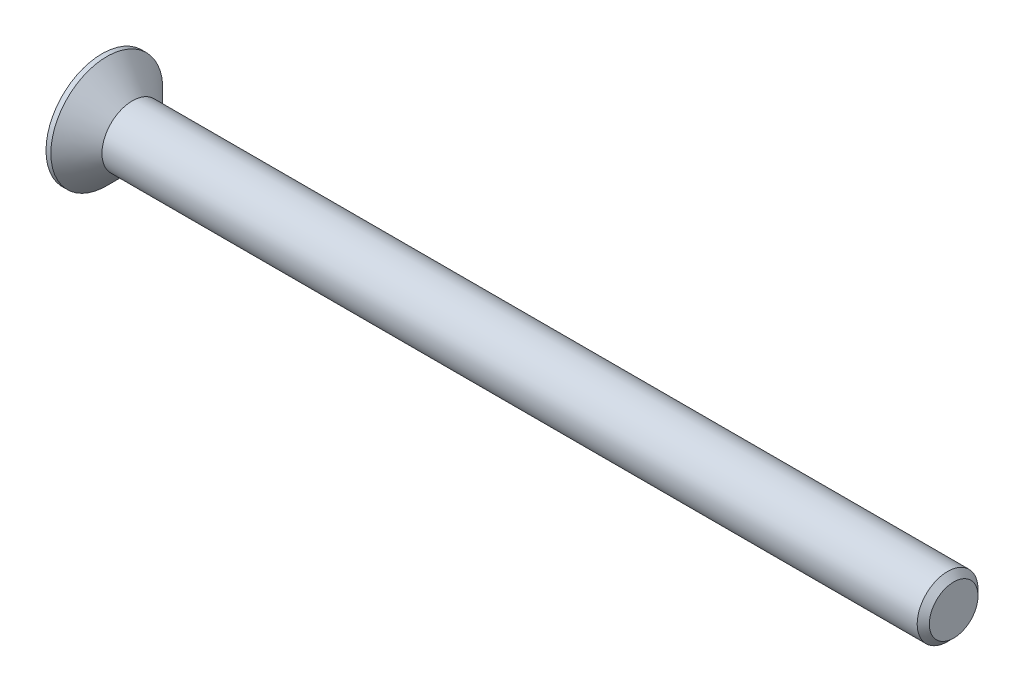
ISO-10303-21;
HEADER;
FILE_DESCRIPTION(('STEP AP214'),'2;1');
FILE_NAME('part.step','',(''),(''),'','','');
FILE_SCHEMA(('AUTOMOTIVE_DESIGN { 1 0 10303 214 1 1 1 1 }'));
ENDSEC;
DATA;
#1=APPLICATION_CONTEXT('core data for automotive mechanical design processes');
#2=APPLICATION_PROTOCOL_DEFINITION('international standard','automotive_design',2000,#1);
#3=PRODUCT_CONTEXT('',#1,'mechanical');
#4=PRODUCT('Part','Part','',(#3));
#5=PRODUCT_RELATED_PRODUCT_CATEGORY('part','',(#4));
#6=PRODUCT_DEFINITION_FORMATION('','',#4);
#7=PRODUCT_DEFINITION_CONTEXT('part definition',#1,'design');
#8=PRODUCT_DEFINITION('design','',#6,#7);
#9=PRODUCT_DEFINITION_SHAPE('','',#8);
#10=(LENGTH_UNIT() NAMED_UNIT(*) SI_UNIT(.MILLI.,.METRE.));
#11=(NAMED_UNIT(*) PLANE_ANGLE_UNIT() SI_UNIT($,.RADIAN.));
#12=(NAMED_UNIT(*) SI_UNIT($,.STERADIAN.) SOLID_ANGLE_UNIT());
#13=UNCERTAINTY_MEASURE_WITH_UNIT(LENGTH_MEASURE(1.E-05),#10,'distance_accuracy_value','');
#14=(GEOMETRIC_REPRESENTATION_CONTEXT(3) GLOBAL_UNCERTAINTY_ASSIGNED_CONTEXT((#13)) GLOBAL_UNIT_ASSIGNED_CONTEXT((#10,
#11,#12)) REPRESENTATION_CONTEXT('',''));
#15=CARTESIAN_POINT('',(0.,0.,0.));
#16=DIRECTION('',(0.,0.,1.));
#17=DIRECTION('',(1.,0.,0.));
#18=AXIS2_PLACEMENT_3D('',#15,#16,#17);
#19=CARTESIAN_POINT('',(0.,0.,0.));
#20=DIRECTION('',(-1.,0.,0.));
#21=DIRECTION('',(0.,0.,1.));
#22=AXIS2_PLACEMENT_3D('',#19,#20,#21);
#23=CONICAL_SURFACE('',#22,2.5,0.78539816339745);
#24=CARTESIAN_POINT('',(-2.09999999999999,0.,0.));
#25=DIRECTION('',(-1.,0.,0.));
#26=DIRECTION('',(0.,0.,1.));
#27=AXIS2_PLACEMENT_3D('',#24,#25,#26);
#28=CIRCLE('',#27,4.6);
#29=CARTESIAN_POINT('',(-2.09999999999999,0.,4.6));
#30=VERTEX_POINT('',#29);
#31=EDGE_CURVE('E189',#30,#30,#28,.T.);
#32=ORIENTED_EDGE('',*,*,#31,.F.);
#33=EDGE_LOOP('',(#32));
#34=FACE_BOUND('',#33,.T.);
#35=CARTESIAN_POINT('',(0.,0.,0.));
#36=DIRECTION('',(-1.,0.,0.));
#37=DIRECTION('',(0.,0.,1.));
#38=AXIS2_PLACEMENT_3D('',#35,#36,#37);
#39=CIRCLE('',#38,2.5);
#40=CARTESIAN_POINT('',(0.,0.,2.5));
#41=VERTEX_POINT('',#40);
#42=EDGE_CURVE('E212',#41,#41,#39,.T.);
#43=ORIENTED_EDGE('',*,*,#42,.T.);
#44=EDGE_LOOP('',(#43));
#45=FACE_BOUND('',#44,.T.);
#46=ADVANCED_FACE('F33',(#34,#45),#23,.T.);
#47=CARTESIAN_POINT('',(-2.5,0.,0.));
#48=DIRECTION('',(-1.,0.,0.));
#49=DIRECTION('',(0.,0.,1.));
#50=AXIS2_PLACEMENT_3D('',#47,#48,#49);
#51=CYLINDRICAL_SURFACE('',#50,2.5);
#52=CARTESIAN_POINT('',(67.,0.,0.));
#53=DIRECTION('',(-1.,0.,0.));
#54=DIRECTION('',(0.,0.,1.));
#55=AXIS2_PLACEMENT_3D('',#52,#53,#54);
#56=CIRCLE('',#55,2.5);
#57=CARTESIAN_POINT('',(67.,0.,2.5));
#58=VERTEX_POINT('',#57);
#59=EDGE_CURVE('E41',#58,#58,#56,.T.);
#60=ORIENTED_EDGE('',*,*,#59,.T.);
#61=EDGE_LOOP('',(#60));
#62=FACE_BOUND('',#61,.T.);
#63=ORIENTED_EDGE('',*,*,#42,.F.);
#64=EDGE_LOOP('',(#63));
#65=FACE_BOUND('',#64,.T.);
#66=ADVANCED_FACE('F217',(#62,#65),#51,.T.);
#67=CARTESIAN_POINT('',(67.5,0.,0.));
#68=DIRECTION('',(-1.,0.,0.));
#69=DIRECTION('',(0.,0.,1.));
#70=AXIS2_PLACEMENT_3D('',#67,#68,#69);
#71=PLANE('',#70);
#72=CARTESIAN_POINT('',(67.5,0.,0.));
#73=DIRECTION('',(-1.,0.,0.));
#74=DIRECTION('',(0.,0.,1.));
#75=AXIS2_PLACEMENT_3D('',#72,#73,#74);
#76=CIRCLE('',#75,2.00000000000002);
#77=CARTESIAN_POINT('',(67.5,0.,2.00000000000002));
#78=VERTEX_POINT('',#77);
#79=EDGE_CURVE('E11',#78,#78,#76,.F.);
#80=ORIENTED_EDGE('',*,*,#79,.T.);
#81=EDGE_LOOP('',(#80));
#82=FACE_BOUND('',#81,.T.);
#83=ADVANCED_FACE('F239',(#82),#71,.F.);
#84=CARTESIAN_POINT('',(-2.5,4.6,0.));
#85=DIRECTION('',(1.,0.,0.));
#86=DIRECTION('',(0.,0.,-1.));
#87=AXIS2_PLACEMENT_3D('',#84,#85,#86);
#88=PLANE('',#87);
#89=DIRECTION('',(0.,0.,-1.));
#90=VECTOR('',#89,1.);
#91=CARTESIAN_POINT('',(-2.5,0.575,-2.3));
#92=LINE('',#91,#90);
#93=CARTESIAN_POINT('',(-2.5,0.575,-0.575));
#94=VERTEX_POINT('',#93);
#95=CARTESIAN_POINT('',(-2.5,0.575,-2.3));
#96=VERTEX_POINT('',#95);
#97=EDGE_CURVE('E158',#94,#96,#92,.T.);
#98=ORIENTED_EDGE('',*,*,#97,.F.);
#99=DIRECTION('',(0.,-1.,0.));
#100=VECTOR('',#99,1.);
#101=CARTESIAN_POINT('',(-2.5,0.575,-0.575));
#102=LINE('',#101,#100);
#103=CARTESIAN_POINT('',(-2.5,2.3,-0.575));
#104=VERTEX_POINT('',#103);
#105=EDGE_CURVE('E48',#104,#94,#102,.T.);
#106=ORIENTED_EDGE('',*,*,#105,.F.);
#107=DIRECTION('',(0.,0.,-1.));
#108=VECTOR('',#107,1.);
#109=CARTESIAN_POINT('',(-2.5,2.3,-0.575));
#110=LINE('',#109,#108);
#111=CARTESIAN_POINT('',(-2.5,2.3,0.575));
#112=VERTEX_POINT('',#111);
#113=EDGE_CURVE('E185',#112,#104,#110,.T.);
#114=ORIENTED_EDGE('',*,*,#113,.F.);
#115=DIRECTION('',(0.,1.,0.));
#116=VECTOR('',#115,1.);
#117=CARTESIAN_POINT('',(-2.5,2.3,0.575));
#118=LINE('',#117,#116);
#119=CARTESIAN_POINT('',(-2.5,0.575,0.575));
#120=VERTEX_POINT('',#119);
#121=EDGE_CURVE('E183',#120,#112,#118,.T.);
#122=ORIENTED_EDGE('',*,*,#121,.F.);
#123=DIRECTION('',(0.,0.,-1.));
#124=VECTOR('',#123,1.);
#125=CARTESIAN_POINT('',(-2.5,0.575,0.575));
#126=LINE('',#125,#124);
#127=CARTESIAN_POINT('',(-2.5,0.575,2.3));
#128=VERTEX_POINT('',#127);
#129=EDGE_CURVE('E132',#128,#120,#126,.T.);
#130=ORIENTED_EDGE('',*,*,#129,.F.);
#131=DIRECTION('',(0.,1.,0.));
#132=VECTOR('',#131,1.);
#133=CARTESIAN_POINT('',(-2.5,0.575,2.3));
#134=LINE('',#133,#132);
#135=CARTESIAN_POINT('',(-2.5,-0.575,2.3));
#136=VERTEX_POINT('',#135);
#137=EDGE_CURVE('E179',#136,#128,#134,.T.);
#138=ORIENTED_EDGE('',*,*,#137,.F.);
#139=DIRECTION('',(0.,0.,1.));
#140=VECTOR('',#139,1.);
#141=CARTESIAN_POINT('',(-2.5,-0.575,2.3));
#142=LINE('',#141,#140);
#143=CARTESIAN_POINT('',(-2.5,-0.575,0.575));
#144=VERTEX_POINT('',#143);
#145=EDGE_CURVE('E176',#144,#136,#142,.T.);
#146=ORIENTED_EDGE('',*,*,#145,.F.);
#147=DIRECTION('',(0.,1.,0.));
#148=VECTOR('',#147,1.);
#149=CARTESIAN_POINT('',(-2.5,-0.575,0.575));
#150=LINE('',#149,#148);
#151=CARTESIAN_POINT('',(-2.5,-2.3,0.575));
#152=VERTEX_POINT('',#151);
#153=EDGE_CURVE('E173',#152,#144,#150,.T.);
#154=ORIENTED_EDGE('',*,*,#153,.F.);
#155=DIRECTION('',(0.,0.,1.));
#156=VECTOR('',#155,1.);
#157=CARTESIAN_POINT('',(-2.5,-2.3,0.575));
#158=LINE('',#157,#156);
#159=CARTESIAN_POINT('',(-2.5,-2.3,-0.575));
#160=VERTEX_POINT('',#159);
#161=EDGE_CURVE('E170',#160,#152,#158,.T.);
#162=ORIENTED_EDGE('',*,*,#161,.F.);
#163=DIRECTION('',(0.,-1.,0.));
#164=VECTOR('',#163,1.);
#165=CARTESIAN_POINT('',(-2.5,-2.3,-0.575));
#166=LINE('',#165,#164);
#167=CARTESIAN_POINT('',(-2.5,-0.575,-0.575));
#168=VERTEX_POINT('',#167);
#169=EDGE_CURVE('E167',#168,#160,#166,.T.);
#170=ORIENTED_EDGE('',*,*,#169,.F.);
#171=DIRECTION('',(0.,0.,1.));
#172=VECTOR('',#171,1.);
#173=CARTESIAN_POINT('',(-2.5,-0.575,-0.575));
#174=LINE('',#173,#172);
#175=CARTESIAN_POINT('',(-2.5,-0.575,-2.3));
#176=VERTEX_POINT('',#175);
#177=EDGE_CURVE('E164',#176,#168,#174,.T.);
#178=ORIENTED_EDGE('',*,*,#177,.F.);
#179=DIRECTION('',(0.,-1.,0.));
#180=VECTOR('',#179,1.);
#181=CARTESIAN_POINT('',(-2.5,-0.575,-2.3));
#182=LINE('',#181,#180);
#183=EDGE_CURVE('E161',#96,#176,#182,.T.);
#184=ORIENTED_EDGE('',*,*,#183,.F.);
#185=EDGE_LOOP('',(#98,#106,#114,#122,#130,#138,#146,#154,#162,#170,#178,#184));
#186=FACE_BOUND('',#185,.T.);
#187=CARTESIAN_POINT('',(-2.5,0.,0.));
#188=DIRECTION('',(-1.,0.,0.));
#189=DIRECTION('',(0.,0.,1.));
#190=AXIS2_PLACEMENT_3D('',#187,#188,#189);
#191=CIRCLE('',#190,4.6);
#192=CARTESIAN_POINT('',(-2.5,0.,4.6));
#193=VERTEX_POINT('',#192);
#194=EDGE_CURVE('E209',#193,#193,#191,.T.);
#195=ORIENTED_EDGE('',*,*,#194,.T.);
#196=EDGE_LOOP('',(#195));
#197=FACE_BOUND('',#196,.T.);
#198=ADVANCED_FACE('F230',(#186,#197),#88,.F.);
#199=CARTESIAN_POINT('',(-2.5,0.,0.));
#200=DIRECTION('',(-1.,0.,0.));
#201=DIRECTION('',(0.,0.,1.));
#202=AXIS2_PLACEMENT_3D('',#199,#200,#201);
#203=CYLINDRICAL_SURFACE('',#202,4.6);
#204=ORIENTED_EDGE('',*,*,#194,.F.);
#205=EDGE_LOOP('',(#204));
#206=FACE_BOUND('',#205,.T.);
#207=ORIENTED_EDGE('',*,*,#31,.T.);
#208=EDGE_LOOP('',(#207));
#209=FACE_BOUND('',#208,.T.);
#210=ADVANCED_FACE('F222',(#206,#209),#203,.T.);
#211=CARTESIAN_POINT('',(67.,0.,0.));
#212=DIRECTION('',(-1.,0.,0.));
#213=DIRECTION('',(0.,0.,1.));
#214=AXIS2_PLACEMENT_3D('',#211,#212,#213);
#215=CONICAL_SURFACE('',#214,2.5,0.78539816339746);
#216=ORIENTED_EDGE('',*,*,#79,.F.);
#217=EDGE_LOOP('',(#216));
#218=FACE_BOUND('',#217,.T.);
#219=ORIENTED_EDGE('',*,*,#59,.F.);
#220=EDGE_LOOP('',(#219));
#221=FACE_BOUND('',#220,.T.);
#222=ADVANCED_FACE('F35',(#218,#221),#215,.T.);
#223=CARTESIAN_POINT('',(-0.4,0.575,-0.575));
#224=DIRECTION('',(0.,0.,-1.));
#225=DIRECTION('',(-1.,0.,0.));
#226=AXIS2_PLACEMENT_3D('',#223,#224,#225);
#227=PLANE('',#226);
#228=ORIENTED_EDGE('',*,*,#105,.T.);
#229=DIRECTION('',(-1.,0.,0.));
#230=VECTOR('',#229,1.);
#231=CARTESIAN_POINT('',(-0.4,0.575,-0.575));
#232=LINE('',#231,#230);
#233=CARTESIAN_POINT('',(-0.4,0.575,-0.575));
#234=VERTEX_POINT('',#233);
#235=EDGE_CURVE('E96',#234,#94,#232,.T.);
#236=ORIENTED_EDGE('',*,*,#235,.F.);
#237=DIRECTION('',(0.,-1.,0.));
#238=VECTOR('',#237,1.);
#239=CARTESIAN_POINT('',(-0.4,0.575,-0.575));
#240=LINE('',#239,#238);
#241=CARTESIAN_POINT('',(-0.4,2.3,-0.575));
#242=VERTEX_POINT('',#241);
#243=EDGE_CURVE('E187',#242,#234,#240,.T.);
#244=ORIENTED_EDGE('',*,*,#243,.F.);
#245=DIRECTION('',(-1.,0.,0.));
#246=VECTOR('',#245,1.);
#247=CARTESIAN_POINT('',(-0.4,2.3,-0.575));
#248=LINE('',#247,#246);
#249=EDGE_CURVE('E56',#242,#104,#248,.T.);
#250=ORIENTED_EDGE('',*,*,#249,.T.);
#251=EDGE_LOOP('',(#228,#236,#244,#250));
#252=FACE_BOUND('',#251,.T.);
#253=ADVANCED_FACE('F221',(#252),#227,.F.);
#254=CARTESIAN_POINT('',(-0.4,2.3,-0.575));
#255=DIRECTION('',(0.,1.,0.));
#256=DIRECTION('',(-1.,0.,0.));
#257=AXIS2_PLACEMENT_3D('',#254,#255,#256);
#258=PLANE('',#257);
#259=ORIENTED_EDGE('',*,*,#113,.T.);
#260=ORIENTED_EDGE('',*,*,#249,.F.);
#261=DIRECTION('',(0.,0.,-1.));
#262=VECTOR('',#261,1.);
#263=CARTESIAN_POINT('',(-0.4,2.3,-0.575));
#264=LINE('',#263,#262);
#265=CARTESIAN_POINT('',(-0.4,2.3,0.575));
#266=VERTEX_POINT('',#265);
#267=EDGE_CURVE('E144',#266,#242,#264,.T.);
#268=ORIENTED_EDGE('',*,*,#267,.F.);
#269=DIRECTION('',(-1.,0.,0.));
#270=VECTOR('',#269,1.);
#271=CARTESIAN_POINT('',(-0.4,2.3,0.575));
#272=LINE('',#271,#270);
#273=EDGE_CURVE('E136',#266,#112,#272,.T.);
#274=ORIENTED_EDGE('',*,*,#273,.T.);
#275=EDGE_LOOP('',(#259,#260,#268,#274));
#276=FACE_BOUND('',#275,.T.);
#277=ADVANCED_FACE('F228',(#276),#258,.F.);
#278=CARTESIAN_POINT('',(-0.4,2.3,0.575));
#279=DIRECTION('',(0.,0.,1.));
#280=DIRECTION('',(1.,0.,0.));
#281=AXIS2_PLACEMENT_3D('',#278,#279,#280);
#282=PLANE('',#281);
#283=ORIENTED_EDGE('',*,*,#121,.T.);
#284=ORIENTED_EDGE('',*,*,#273,.F.);
#285=DIRECTION('',(0.,1.,0.));
#286=VECTOR('',#285,1.);
#287=CARTESIAN_POINT('',(-0.4,2.3,0.575));
#288=LINE('',#287,#286);
#289=CARTESIAN_POINT('',(-0.4,0.575,0.575));
#290=VERTEX_POINT('',#289);
#291=EDGE_CURVE('E140',#290,#266,#288,.T.);
#292=ORIENTED_EDGE('',*,*,#291,.F.);
#293=DIRECTION('',(-1.,0.,0.));
#294=VECTOR('',#293,1.);
#295=CARTESIAN_POINT('',(-0.4,0.575,0.575));
#296=LINE('',#295,#294);
#297=EDGE_CURVE('E125',#290,#120,#296,.T.);
#298=ORIENTED_EDGE('',*,*,#297,.T.);
#299=EDGE_LOOP('',(#283,#284,#292,#298));
#300=FACE_BOUND('',#299,.T.);
#301=ADVANCED_FACE('F141',(#300),#282,.F.);
#302=CARTESIAN_POINT('',(-0.4,0.575,0.575));
#303=DIRECTION('',(0.,1.,0.));
#304=DIRECTION('',(-1.,0.,0.));
#305=AXIS2_PLACEMENT_3D('',#302,#303,#304);
#306=PLANE('',#305);
#307=ORIENTED_EDGE('',*,*,#129,.T.);
#308=ORIENTED_EDGE('',*,*,#297,.F.);
#309=DIRECTION('',(0.,0.,-1.));
#310=VECTOR('',#309,1.);
#311=CARTESIAN_POINT('',(-0.4,0.575,0.575));
#312=LINE('',#311,#310);
#313=CARTESIAN_POINT('',(-0.4,0.575,2.3));
#314=VERTEX_POINT('',#313);
#315=EDGE_CURVE('E129',#314,#290,#312,.T.);
#316=ORIENTED_EDGE('',*,*,#315,.F.);
#317=DIRECTION('',(-1.,0.,0.));
#318=VECTOR('',#317,1.);
#319=CARTESIAN_POINT('',(-0.4,0.575,2.3));
#320=LINE('',#319,#318);
#321=EDGE_CURVE('E137',#314,#128,#320,.T.);
#322=ORIENTED_EDGE('',*,*,#321,.T.);
#323=EDGE_LOOP('',(#307,#308,#316,#322));
#324=FACE_BOUND('',#323,.T.);
#325=ADVANCED_FACE('F127',(#324),#306,.F.);
#326=CARTESIAN_POINT('',(-0.4,0.575,2.3));
#327=DIRECTION('',(0.,0.,1.));
#328=DIRECTION('',(1.,0.,0.));
#329=AXIS2_PLACEMENT_3D('',#326,#327,#328);
#330=PLANE('',#329);
#331=ORIENTED_EDGE('',*,*,#137,.T.);
#332=ORIENTED_EDGE('',*,*,#321,.F.);
#333=DIRECTION('',(0.,1.,0.));
#334=VECTOR('',#333,1.);
#335=CARTESIAN_POINT('',(-0.4,0.575,2.3));
#336=LINE('',#335,#334);
#337=CARTESIAN_POINT('',(-0.4,-0.575,2.3));
#338=VERTEX_POINT('',#337);
#339=EDGE_CURVE('E150',#338,#314,#336,.T.);
#340=ORIENTED_EDGE('',*,*,#339,.F.);
#341=DIRECTION('',(-1.,0.,0.));
#342=VECTOR('',#341,1.);
#343=CARTESIAN_POINT('',(-0.4,-0.575,2.3));
#344=LINE('',#343,#342);
#345=EDGE_CURVE('E192',#338,#136,#344,.T.);
#346=ORIENTED_EDGE('',*,*,#345,.T.);
#347=EDGE_LOOP('',(#331,#332,#340,#346));
#348=FACE_BOUND('',#347,.T.);
#349=ADVANCED_FACE('F277',(#348),#330,.F.);
#350=CARTESIAN_POINT('',(-0.4,-0.575,2.3));
#351=DIRECTION('',(0.,-1.,0.));
#352=DIRECTION('',(1.,0.,0.));
#353=AXIS2_PLACEMENT_3D('',#350,#351,#352);
#354=PLANE('',#353);
#355=ORIENTED_EDGE('',*,*,#145,.T.);
#356=ORIENTED_EDGE('',*,*,#345,.F.);
#357=DIRECTION('',(0.,0.,1.));
#358=VECTOR('',#357,1.);
#359=CARTESIAN_POINT('',(-0.4,-0.575,2.3));
#360=LINE('',#359,#358);
#361=CARTESIAN_POINT('',(-0.4,-0.575,0.575));
#362=VERTEX_POINT('',#361);
#363=EDGE_CURVE('E152',#362,#338,#360,.T.);
#364=ORIENTED_EDGE('',*,*,#363,.F.);
#365=DIRECTION('',(-1.,0.,0.));
#366=VECTOR('',#365,1.);
#367=CARTESIAN_POINT('',(-0.4,-0.575,0.575));
#368=LINE('',#367,#366);
#369=EDGE_CURVE('E194',#362,#144,#368,.T.);
#370=ORIENTED_EDGE('',*,*,#369,.T.);
#371=EDGE_LOOP('',(#355,#356,#364,#370));
#372=FACE_BOUND('',#371,.T.);
#373=ADVANCED_FACE('F273',(#372),#354,.F.);
#374=CARTESIAN_POINT('',(-0.4,-0.575,0.575));
#375=DIRECTION('',(0.,0.,1.));
#376=DIRECTION('',(1.,0.,0.));
#377=AXIS2_PLACEMENT_3D('',#374,#375,#376);
#378=PLANE('',#377);
#379=ORIENTED_EDGE('',*,*,#153,.T.);
#380=ORIENTED_EDGE('',*,*,#369,.F.);
#381=DIRECTION('',(0.,1.,0.));
#382=VECTOR('',#381,1.);
#383=CARTESIAN_POINT('',(-0.4,-0.575,0.575));
#384=LINE('',#383,#382);
#385=CARTESIAN_POINT('',(-0.4,-2.3,0.575));
#386=VERTEX_POINT('',#385);
#387=EDGE_CURVE('E422',#386,#362,#384,.T.);
#388=ORIENTED_EDGE('',*,*,#387,.F.);
#389=DIRECTION('',(-1.,0.,0.));
#390=VECTOR('',#389,1.);
#391=CARTESIAN_POINT('',(-0.4,-2.3,0.575));
#392=LINE('',#391,#390);
#393=EDGE_CURVE('E196',#386,#152,#392,.T.);
#394=ORIENTED_EDGE('',*,*,#393,.T.);
#395=EDGE_LOOP('',(#379,#380,#388,#394));
#396=FACE_BOUND('',#395,.T.);
#397=ADVANCED_FACE('F269',(#396),#378,.F.);
#398=CARTESIAN_POINT('',(-0.4,-2.3,0.575));
#399=DIRECTION('',(0.,-1.,0.));
#400=DIRECTION('',(1.,0.,0.));
#401=AXIS2_PLACEMENT_3D('',#398,#399,#400);
#402=PLANE('',#401);
#403=ORIENTED_EDGE('',*,*,#161,.T.);
#404=ORIENTED_EDGE('',*,*,#393,.F.);
#405=DIRECTION('',(0.,0.,1.));
#406=VECTOR('',#405,1.);
#407=CARTESIAN_POINT('',(-0.4,-2.3,0.575));
#408=LINE('',#407,#406);
#409=CARTESIAN_POINT('',(-0.4,-2.3,-0.575));
#410=VERTEX_POINT('',#409);
#411=EDGE_CURVE('E419',#410,#386,#408,.T.);
#412=ORIENTED_EDGE('',*,*,#411,.F.);
#413=DIRECTION('',(-1.,0.,0.));
#414=VECTOR('',#413,1.);
#415=CARTESIAN_POINT('',(-0.4,-2.3,-0.575));
#416=LINE('',#415,#414);
#417=EDGE_CURVE('E198',#410,#160,#416,.T.);
#418=ORIENTED_EDGE('',*,*,#417,.T.);
#419=EDGE_LOOP('',(#403,#404,#412,#418));
#420=FACE_BOUND('',#419,.T.);
#421=ADVANCED_FACE('F265',(#420),#402,.F.);
#422=CARTESIAN_POINT('',(-0.4,-2.3,-0.575));
#423=DIRECTION('',(0.,0.,-1.));
#424=DIRECTION('',(-1.,0.,0.));
#425=AXIS2_PLACEMENT_3D('',#422,#423,#424);
#426=PLANE('',#425);
#427=ORIENTED_EDGE('',*,*,#169,.T.);
#428=ORIENTED_EDGE('',*,*,#417,.F.);
#429=DIRECTION('',(0.,-1.,0.));
#430=VECTOR('',#429,1.);
#431=CARTESIAN_POINT('',(-0.4,-2.3,-0.575));
#432=LINE('',#431,#430);
#433=CARTESIAN_POINT('',(-0.4,-0.575,-0.575));
#434=VERTEX_POINT('',#433);
#435=EDGE_CURVE('E416',#434,#410,#432,.T.);
#436=ORIENTED_EDGE('',*,*,#435,.F.);
#437=DIRECTION('',(-1.,0.,0.));
#438=VECTOR('',#437,1.);
#439=CARTESIAN_POINT('',(-0.4,-0.575,-0.575));
#440=LINE('',#439,#438);
#441=EDGE_CURVE('E200',#434,#168,#440,.T.);
#442=ORIENTED_EDGE('',*,*,#441,.T.);
#443=EDGE_LOOP('',(#427,#428,#436,#442));
#444=FACE_BOUND('',#443,.T.);
#445=ADVANCED_FACE('F261',(#444),#426,.F.);
#446=CARTESIAN_POINT('',(-0.4,-0.575,-0.575));
#447=DIRECTION('',(0.,-1.,0.));
#448=DIRECTION('',(1.,0.,0.));
#449=AXIS2_PLACEMENT_3D('',#446,#447,#448);
#450=PLANE('',#449);
#451=ORIENTED_EDGE('',*,*,#177,.T.);
#452=ORIENTED_EDGE('',*,*,#441,.F.);
#453=DIRECTION('',(0.,0.,1.));
#454=VECTOR('',#453,1.);
#455=CARTESIAN_POINT('',(-0.4,-0.575,-0.575));
#456=LINE('',#455,#454);
#457=CARTESIAN_POINT('',(-0.4,-0.575,-2.3));
#458=VERTEX_POINT('',#457);
#459=EDGE_CURVE('E413',#458,#434,#456,.T.);
#460=ORIENTED_EDGE('',*,*,#459,.F.);
#461=DIRECTION('',(-1.,0.,0.));
#462=VECTOR('',#461,1.);
#463=CARTESIAN_POINT('',(-0.4,-0.575,-2.3));
#464=LINE('',#463,#462);
#465=EDGE_CURVE('E202',#458,#176,#464,.T.);
#466=ORIENTED_EDGE('',*,*,#465,.T.);
#467=EDGE_LOOP('',(#451,#452,#460,#466));
#468=FACE_BOUND('',#467,.T.);
#469=ADVANCED_FACE('F257',(#468),#450,.F.);
#470=CARTESIAN_POINT('',(-0.4,-0.575,-2.3));
#471=DIRECTION('',(0.,0.,-1.));
#472=DIRECTION('',(-1.,0.,0.));
#473=AXIS2_PLACEMENT_3D('',#470,#471,#472);
#474=PLANE('',#473);
#475=ORIENTED_EDGE('',*,*,#183,.T.);
#476=ORIENTED_EDGE('',*,*,#465,.F.);
#477=DIRECTION('',(0.,-1.,0.));
#478=VECTOR('',#477,1.);
#479=CARTESIAN_POINT('',(-0.4,-0.575,-2.3));
#480=LINE('',#479,#478);
#481=CARTESIAN_POINT('',(-0.4,0.575,-2.3));
#482=VERTEX_POINT('',#481);
#483=EDGE_CURVE('E408',#482,#458,#480,.T.);
#484=ORIENTED_EDGE('',*,*,#483,.F.);
#485=DIRECTION('',(-1.,0.,0.));
#486=VECTOR('',#485,1.);
#487=CARTESIAN_POINT('',(-0.4,0.575,-2.3));
#488=LINE('',#487,#486);
#489=EDGE_CURVE('E204',#482,#96,#488,.T.);
#490=ORIENTED_EDGE('',*,*,#489,.T.);
#491=EDGE_LOOP('',(#475,#476,#484,#490));
#492=FACE_BOUND('',#491,.T.);
#493=ADVANCED_FACE('F253',(#492),#474,.F.);
#494=CARTESIAN_POINT('',(-0.4,0.575,-2.3));
#495=DIRECTION('',(0.,1.,0.));
#496=DIRECTION('',(-1.,0.,0.));
#497=AXIS2_PLACEMENT_3D('',#494,#495,#496);
#498=PLANE('',#497);
#499=ORIENTED_EDGE('',*,*,#97,.T.);
#500=ORIENTED_EDGE('',*,*,#489,.F.);
#501=DIRECTION('',(0.,0.,-1.));
#502=VECTOR('',#501,1.);
#503=CARTESIAN_POINT('',(-0.4,0.575,-2.3));
#504=LINE('',#503,#502);
#505=EDGE_CURVE('E406',#234,#482,#504,.T.);
#506=ORIENTED_EDGE('',*,*,#505,.F.);
#507=ORIENTED_EDGE('',*,*,#235,.T.);
#508=EDGE_LOOP('',(#499,#500,#506,#507));
#509=FACE_BOUND('',#508,.T.);
#510=ADVANCED_FACE('F250',(#509),#498,.F.);
#511=CARTESIAN_POINT('',(-0.4,0.,0.));
#512=DIRECTION('',(1.,0.,0.));
#513=DIRECTION('',(0.,0.,-1.));
#514=AXIS2_PLACEMENT_3D('',#511,#512,#513);
#515=PLANE('',#514);
#516=ORIENTED_EDGE('',*,*,#243,.T.);
#517=ORIENTED_EDGE('',*,*,#505,.T.);
#518=ORIENTED_EDGE('',*,*,#483,.T.);
#519=ORIENTED_EDGE('',*,*,#459,.T.);
#520=ORIENTED_EDGE('',*,*,#435,.T.);
#521=ORIENTED_EDGE('',*,*,#411,.T.);
#522=ORIENTED_EDGE('',*,*,#387,.T.);
#523=ORIENTED_EDGE('',*,*,#363,.T.);
#524=ORIENTED_EDGE('',*,*,#339,.T.);
#525=ORIENTED_EDGE('',*,*,#315,.T.);
#526=ORIENTED_EDGE('',*,*,#291,.T.);
#527=ORIENTED_EDGE('',*,*,#267,.T.);
#528=EDGE_LOOP('',(#516,#517,#518,#519,#520,#521,#522,#523,#524,#525,#526,#527));
#529=FACE_BOUND('',#528,.T.);
#530=ADVANCED_FACE('F147',(#529),#515,.F.);
#531=CLOSED_SHELL('',(#46,#66,#83,#198,#210,#222,#253,#277,#301,#325,#349,#373,#397,#421,#445,
#469,#493,#510,#530));
#532=MANIFOLD_SOLID_BREP('B2',#531);
#533=ADVANCED_BREP_SHAPE_REPRESENTATION('',(#18,#532),#14);
#534=SHAPE_DEFINITION_REPRESENTATION(#9,#533);
ENDSEC;
END-ISO-10303-21;
